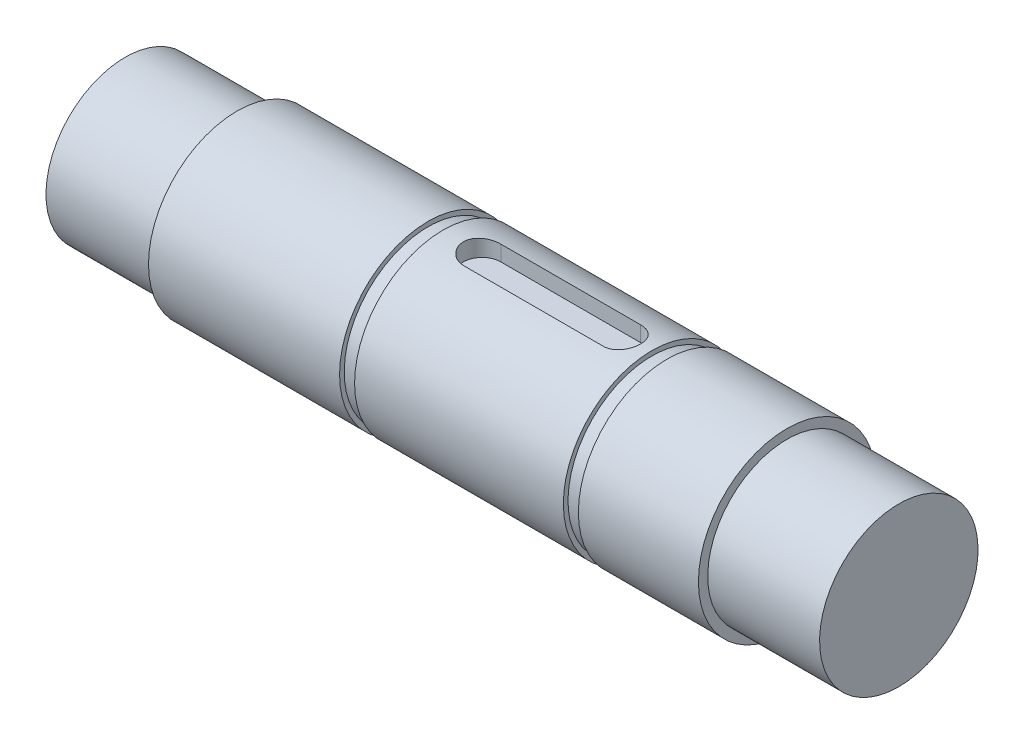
ISO-10303-21;
HEADER;
FILE_DESCRIPTION(('STEP AP214'),'2;1');
FILE_NAME('part.step','',(''),(''),'','','');
FILE_SCHEMA(('AUTOMOTIVE_DESIGN { 1 0 10303 214 1 1 1 1 }'));
ENDSEC;
DATA;
#1=APPLICATION_CONTEXT('core data for automotive mechanical design processes');
#2=APPLICATION_PROTOCOL_DEFINITION('international standard','automotive_design',2000,#1);
#3=PRODUCT_CONTEXT('',#1,'mechanical');
#4=PRODUCT('Part','Part','',(#3));
#5=PRODUCT_RELATED_PRODUCT_CATEGORY('part','',(#4));
#6=PRODUCT_DEFINITION_FORMATION('','',#4);
#7=PRODUCT_DEFINITION_CONTEXT('part definition',#1,'design');
#8=PRODUCT_DEFINITION('design','',#6,#7);
#9=PRODUCT_DEFINITION_SHAPE('','',#8);
#10=(LENGTH_UNIT() NAMED_UNIT(*) SI_UNIT(.MILLI.,.METRE.));
#11=(NAMED_UNIT(*) PLANE_ANGLE_UNIT() SI_UNIT($,.RADIAN.));
#12=(NAMED_UNIT(*) SI_UNIT($,.STERADIAN.) SOLID_ANGLE_UNIT());
#13=UNCERTAINTY_MEASURE_WITH_UNIT(LENGTH_MEASURE(1.E-05),#10,'distance_accuracy_value','');
#14=(GEOMETRIC_REPRESENTATION_CONTEXT(3) GLOBAL_UNCERTAINTY_ASSIGNED_CONTEXT((#13)) GLOBAL_UNIT_ASSIGNED_CONTEXT((#10,
#11,#12)) REPRESENTATION_CONTEXT('',''));
#15=CARTESIAN_POINT('',(0.,0.,0.));
#16=DIRECTION('',(0.,0.,1.));
#17=DIRECTION('',(1.,0.,0.));
#18=AXIS2_PLACEMENT_3D('',#15,#16,#17);
#19=CARTESIAN_POINT('',(70.9267361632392,9.41100770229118,0.));
#20=DIRECTION('',(-1.,0.,0.));
#21=DIRECTION('',(0.,-1.,0.));
#22=AXIS2_PLACEMENT_3D('',#19,#20,#21);
#23=CYLINDRICAL_SURFACE('',#22,9.50000000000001);
#24=CARTESIAN_POINT('',(127.436736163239,9.41100770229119,0.));
#25=DIRECTION('',(-1.,0.,0.));
#26=DIRECTION('',(0.,-1.,0.));
#27=AXIS2_PLACEMENT_3D('',#24,#25,#26);
#28=CIRCLE('',#27,9.50000000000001);
#29=CARTESIAN_POINT('',(127.436736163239,-0.0889922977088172,0.));
#30=VERTEX_POINT('',#29);
#31=EDGE_CURVE('E127',#30,#30,#28,.T.);
#32=ORIENTED_EDGE('',*,*,#31,.T.);
#33=EDGE_LOOP('',(#32));
#34=FACE_BOUND('',#33,.T.);
#35=CARTESIAN_POINT('',(105.036736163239,9.41100770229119,0.));
#36=DIRECTION('',(-1.,0.,0.));
#37=DIRECTION('',(0.,-1.,0.));
#38=AXIS2_PLACEMENT_3D('',#35,#36,#37);
#39=CIRCLE('',#38,9.5);
#40=CARTESIAN_POINT('',(105.036736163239,-0.0889922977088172,0.));
#41=VERTEX_POINT('',#40);
#42=EDGE_CURVE('E130',#41,#41,#39,.T.);
#43=ORIENTED_EDGE('',*,*,#42,.F.);
#44=EDGE_LOOP('',(#43));
#45=FACE_BOUND('',#44,.T.);
#46=DIRECTION('',(-1.,0.,0.));
#47=VECTOR('',#46,1.);
#48=CARTESIAN_POINT('',(70.9267361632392,18.6980955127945,2.));
#49=LINE('',#48,#47);
#50=CARTESIAN_POINT('',(109.220439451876,18.6980955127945,2.));
#51=VERTEX_POINT('',#50);
#52=CARTESIAN_POINT('',(124.220439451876,18.6980955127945,2.));
#53=VERTEX_POINT('',#52);
#54=EDGE_CURVE('E50',#51,#53,#49,.F.);
#55=ORIENTED_EDGE('',*,*,#54,.F.);
#56=CARTESIAN_POINT('',(109.220439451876,18.6980955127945,2.));
#57=CARTESIAN_POINT('',(109.164837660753,18.6980924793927,2.00000036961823));
#58=CARTESIAN_POINT('',(109.109263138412,18.6985954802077,1.99767985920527));
#59=CARTESIAN_POINT('',(108.998524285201,18.7005819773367,1.98842727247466));
#60=CARTESIAN_POINT('',(108.943359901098,18.702065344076,1.98149580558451));
#61=CARTESIAN_POINT('',(108.779266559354,18.7079290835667,1.9538753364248));
#62=CARTESIAN_POINT('',(108.671456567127,18.713723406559,1.92635991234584));
#63=CARTESIAN_POINT('',(108.462118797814,18.7284166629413,1.85397836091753));
#64=CARTESIAN_POINT('',(108.360591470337,18.7373158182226,1.80911099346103));
#65=CARTESIAN_POINT('',(108.166470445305,18.7572113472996,1.70333893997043));
#66=CARTESIAN_POINT('',(108.073877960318,18.7682080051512,1.64243208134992));
#67=CARTESIAN_POINT('',(107.898855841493,18.7912495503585,1.5053071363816));
#68=CARTESIAN_POINT('',(107.816585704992,18.8033069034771,1.42888762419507));
#69=CARTESIAN_POINT('',(107.665924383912,18.8270031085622,1.2633333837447));
#70=CARTESIAN_POINT('',(107.59753536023,18.8386418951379,1.17419667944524));
#71=CARTESIAN_POINT('',(107.475957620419,18.8603247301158,0.984671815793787));
#72=CARTESIAN_POINT('',(107.422922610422,18.8703522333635,0.884183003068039));
#73=CARTESIAN_POINT('',(107.334553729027,18.8875406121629,0.675478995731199));
#74=CARTESIAN_POINT('',(107.299217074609,18.8947019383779,0.56726501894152));
#75=CARTESIAN_POINT('',(107.247747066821,18.9052630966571,0.347847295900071));
#76=CARTESIAN_POINT('',(107.231341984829,18.9087161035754,0.236709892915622));
#77=CARTESIAN_POINT('',(107.217351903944,18.9116555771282,0.0132077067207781));
#78=CARTESIAN_POINT('',(107.219765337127,18.91114237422,-0.0991569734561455));
#79=CARTESIAN_POINT('',(107.243140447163,18.9062479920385,-0.320048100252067));
#80=CARTESIAN_POINT('',(107.263808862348,18.901927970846,-0.428607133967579));
#81=CARTESIAN_POINT('',(107.32264071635,18.8899747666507,-0.640679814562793));
#82=CARTESIAN_POINT('',(107.360804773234,18.8823414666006,-0.744193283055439));
#83=CARTESIAN_POINT('',(107.453810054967,18.8645198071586,-0.944063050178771));
#84=CARTESIAN_POINT('',(107.508764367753,18.8543142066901,-1.04036512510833));
#85=CARTESIAN_POINT('',(107.633704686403,18.8324701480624,-1.22248539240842));
#86=CARTESIAN_POINT('',(107.70369214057,18.8208315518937,-1.30830257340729));
#87=CARTESIAN_POINT('',(107.858303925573,18.7971399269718,-1.46875307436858));
#88=CARTESIAN_POINT('',(107.943183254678,18.7850832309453,-1.54314030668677));
#89=CARTESIAN_POINT('',(108.12436236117,18.7621213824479,-1.67668718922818));
#90=CARTESIAN_POINT('',(108.22066527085,18.7512165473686,-1.73584264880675));
#91=CARTESIAN_POINT('',(108.422350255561,18.7317825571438,-1.83734744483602));
#92=CARTESIAN_POINT('',(108.527759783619,18.723260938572,-1.87964364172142));
#93=CARTESIAN_POINT('',(108.744344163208,18.7096661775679,-1.94579296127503));
#94=CARTESIAN_POINT('',(108.855510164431,18.7045879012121,-1.9696735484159));
#95=CARTESIAN_POINT('',(109.009723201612,18.7003899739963,-1.98932013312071));
#96=CARTESIAN_POINT('',(109.051798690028,18.6995305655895,-1.99332635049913));
#97=CARTESIAN_POINT('',(109.136056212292,18.6983837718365,-1.99866298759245));
#98=CARTESIAN_POINT('',(109.178237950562,18.6980954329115,-1.99999786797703));
#99=CARTESIAN_POINT('',(109.220439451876,18.6980955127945,-2.));
#100=B_SPLINE_CURVE_WITH_KNOTS('',3,(#56,#57,#58,#59,#60,#61,#62,#63,#64,#65,#66,#67,#68,#69,
#70,#71,#72,#73,#74,#75,#76,#77,#78,#79,#80,#81,#82,#83,#84,#85,#86,#87,#88,#89,#90,#91,#92,#93,
#94,#95,#96,#97,#98,#99),.UNSPECIFIED.,.F.,.F.,(4,2,2,2,2,2,2,2,2,2,2,2,2,2,2,2,2,2,2,2,2,4),
(0.,0.16670089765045,0.333379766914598,0.665905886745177,0.998455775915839,1.3310507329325,
1.66827773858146,2.0055572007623,2.3461047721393,2.68659877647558,3.02214231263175,
3.35765789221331,3.68787958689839,4.01811294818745,4.35062149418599,4.68316208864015,
5.02208107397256,5.36109320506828,5.70116559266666,6.04072982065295,6.16748468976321,
6.29402772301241),.UNSPECIFIED.);
#101=CARTESIAN_POINT('',(109.220439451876,18.6980955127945,-2.));
#102=VERTEX_POINT('',#101);
#103=EDGE_CURVE('E84',#51,#102,#100,.T.);
#104=ORIENTED_EDGE('',*,*,#103,.T.);
#105=DIRECTION('',(-1.,0.,0.));
#106=VECTOR('',#105,1.);
#107=CARTESIAN_POINT('',(70.9267361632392,18.6980955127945,-2.));
#108=LINE('',#107,#106);
#109=CARTESIAN_POINT('',(124.220439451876,18.6980955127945,-2.));
#110=VERTEX_POINT('',#109);
#111=EDGE_CURVE('E11',#110,#102,#108,.T.);
#112=ORIENTED_EDGE('',*,*,#111,.F.);
#113=CARTESIAN_POINT('',(124.220439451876,18.6980955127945,-2.));
#114=CARTESIAN_POINT('',(124.276041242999,18.6980924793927,-2.00000036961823));
#115=CARTESIAN_POINT('',(124.33161576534,18.6985954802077,-1.99767985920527));
#116=CARTESIAN_POINT('',(124.44235461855,18.7005819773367,-1.98842727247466));
#117=CARTESIAN_POINT('',(124.497519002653,18.702065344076,-1.98149580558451));
#118=CARTESIAN_POINT('',(124.661612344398,18.7079290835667,-1.95387533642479));
#119=CARTESIAN_POINT('',(124.769422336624,18.713723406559,-1.92635991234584));
#120=CARTESIAN_POINT('',(124.978760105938,18.7284166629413,-1.85397836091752));
#121=CARTESIAN_POINT('',(125.080287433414,18.7373158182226,-1.80911099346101));
#122=CARTESIAN_POINT('',(125.274408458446,18.7572113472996,-1.70333893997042));
#123=CARTESIAN_POINT('',(125.367000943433,18.7682080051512,-1.64243208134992));
#124=CARTESIAN_POINT('',(125.542023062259,18.7912495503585,-1.5053071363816));
#125=CARTESIAN_POINT('',(125.624293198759,18.8033069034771,-1.42888762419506));
#126=CARTESIAN_POINT('',(125.774954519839,18.8270031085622,-1.26333338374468));
#127=CARTESIAN_POINT('',(125.843343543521,18.8386418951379,-1.17419667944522));
#128=CARTESIAN_POINT('',(125.964921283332,18.8603247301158,-0.984671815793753));
#129=CARTESIAN_POINT('',(126.01795629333,18.8703522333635,-0.884183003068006));
#130=CARTESIAN_POINT('',(126.106325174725,18.8875406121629,-0.675478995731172));
#131=CARTESIAN_POINT('',(126.141661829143,18.8947019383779,-0.567265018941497));
#132=CARTESIAN_POINT('',(126.19313183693,18.9052630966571,-0.347847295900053));
#133=CARTESIAN_POINT('',(126.209536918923,18.9087161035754,-0.236709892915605));
#134=CARTESIAN_POINT('',(126.223526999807,18.9116555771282,-0.0132077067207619));
#135=CARTESIAN_POINT('',(126.221113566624,18.91114237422,0.0991569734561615));
#136=CARTESIAN_POINT('',(126.197738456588,18.9062479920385,0.320048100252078));
#137=CARTESIAN_POINT('',(126.177070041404,18.901927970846,0.428607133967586));
#138=CARTESIAN_POINT('',(126.118238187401,18.8899747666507,0.640679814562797));
#139=CARTESIAN_POINT('',(126.080074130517,18.8823414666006,0.744193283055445));
#140=CARTESIAN_POINT('',(125.987068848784,18.8645198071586,0.944063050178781));
#141=CARTESIAN_POINT('',(125.932114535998,18.8543142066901,1.04036512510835));
#142=CARTESIAN_POINT('',(125.807174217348,18.8324701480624,1.22248539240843));
#143=CARTESIAN_POINT('',(125.737186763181,18.8208315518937,1.3083025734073));
#144=CARTESIAN_POINT('',(125.582574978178,18.7971399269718,1.46875307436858));
#145=CARTESIAN_POINT('',(125.497695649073,18.7850832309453,1.54314030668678));
#146=CARTESIAN_POINT('',(125.316516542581,18.7621213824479,1.67668718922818));
#147=CARTESIAN_POINT('',(125.220213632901,18.7512165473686,1.73584264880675));
#148=CARTESIAN_POINT('',(125.018528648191,18.7317825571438,1.83734744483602));
#149=CARTESIAN_POINT('',(124.913119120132,18.723260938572,1.87964364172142));
#150=CARTESIAN_POINT('',(124.696534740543,18.7096661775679,1.94579296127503));
#151=CARTESIAN_POINT('',(124.58536873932,18.7045879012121,1.9696735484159));
#152=CARTESIAN_POINT('',(124.431155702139,18.7003899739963,1.98932013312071));
#153=CARTESIAN_POINT('',(124.389080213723,18.6995305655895,1.99332635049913));
#154=CARTESIAN_POINT('',(124.304822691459,18.6983837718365,1.99866298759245));
#155=CARTESIAN_POINT('',(124.262640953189,18.6980954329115,1.99999786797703));
#156=CARTESIAN_POINT('',(124.220439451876,18.6980955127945,2.));
#157=B_SPLINE_CURVE_WITH_KNOTS('',3,(#113,#114,#115,#116,#117,#118,#119,#120,#121,#122,#123,
#124,#125,#126,#127,#128,#129,#130,#131,#132,#133,#134,#135,#136,#137,#138,#139,#140,#141,#142,
#143,#144,#145,#146,#147,#148,#149,#150,#151,#152,#153,#154,#155,#156),.UNSPECIFIED.,.F.,.F.,(4,
2,2,2,2,2,2,2,2,2,2,2,2,2,2,2,2,2,2,2,2,4),(0.,0.166700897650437,0.333379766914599,
0.665905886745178,0.998455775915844,1.33105073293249,1.66827773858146,2.00555720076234,
2.34610477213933,2.68659877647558,3.02214231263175,3.35765789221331,3.68787958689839,
4.01811294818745,4.35062149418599,4.68316208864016,5.02208107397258,5.36109320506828,
5.70116559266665,6.04072982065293,6.1674846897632,6.2940277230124),.UNSPECIFIED.);
#158=EDGE_CURVE('E108',#110,#53,#157,.T.);
#159=ORIENTED_EDGE('',*,*,#158,.T.);
#160=EDGE_LOOP('',(#55,#104,#112,#159));
#161=FACE_BOUND('',#160,.T.);
#162=ADVANCED_FACE('F41',(#34,#45,#161),#23,.T.);
#163=CARTESIAN_POINT('',(70.9267361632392,0.,0.));
#164=DIRECTION('',(1.,0.,0.));
#165=DIRECTION('',(0.,1.,0.));
#166=AXIS2_PLACEMENT_3D('',#163,#164,#165);
#167=PLANE('',#166);
#168=CARTESIAN_POINT('',(70.9267361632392,9.41100770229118,0.));
#169=DIRECTION('',(-1.,0.,0.));
#170=DIRECTION('',(0.,-1.,0.));
#171=AXIS2_PLACEMENT_3D('',#168,#169,#170);
#172=CIRCLE('',#171,8.5);
#173=CARTESIAN_POINT('',(70.9267361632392,0.911007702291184,0.));
#174=VERTEX_POINT('',#173);
#175=EDGE_CURVE('E148',#174,#174,#172,.T.);
#176=ORIENTED_EDGE('',*,*,#175,.T.);
#177=EDGE_LOOP('',(#176));
#178=FACE_BOUND('',#177,.T.);
#179=ADVANCED_FACE('F43',(#178),#167,.F.);
#180=CARTESIAN_POINT('',(70.9267361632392,9.41100770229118,0.));
#181=DIRECTION('',(-1.,0.,0.));
#182=DIRECTION('',(0.,-1.,0.));
#183=AXIS2_PLACEMENT_3D('',#180,#181,#182);
#184=CYLINDRICAL_SURFACE('',#183,8.5);
#185=CARTESIAN_POINT('',(82.9267361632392,9.41100770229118,0.));
#186=DIRECTION('',(-1.,0.,0.));
#187=DIRECTION('',(0.,-1.,0.));
#188=AXIS2_PLACEMENT_3D('',#185,#186,#187);
#189=CIRCLE('',#188,8.5);
#190=CARTESIAN_POINT('',(82.9267361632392,0.911007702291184,0.));
#191=VERTEX_POINT('',#190);
#192=EDGE_CURVE('E145',#191,#191,#189,.T.);
#193=ORIENTED_EDGE('',*,*,#192,.T.);
#194=EDGE_LOOP('',(#193));
#195=FACE_BOUND('',#194,.T.);
#196=ORIENTED_EDGE('',*,*,#175,.F.);
#197=EDGE_LOOP('',(#196));
#198=FACE_BOUND('',#197,.T.);
#199=ADVANCED_FACE('F153',(#195,#198),#184,.T.);
#200=CARTESIAN_POINT('',(82.9267361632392,0.,0.));
#201=DIRECTION('',(-1.,0.,0.));
#202=DIRECTION('',(0.,-1.,0.));
#203=AXIS2_PLACEMENT_3D('',#200,#201,#202);
#204=PLANE('',#203);
#205=CARTESIAN_POINT('',(82.9267361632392,9.41100770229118,0.));
#206=DIRECTION('',(-1.,0.,0.));
#207=DIRECTION('',(0.,-1.,0.));
#208=AXIS2_PLACEMENT_3D('',#205,#206,#207);
#209=CIRCLE('',#208,9.5);
#210=CARTESIAN_POINT('',(82.9267361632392,-0.0889922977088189,0.));
#211=VERTEX_POINT('',#210);
#212=EDGE_CURVE('E142',#211,#211,#209,.T.);
#213=ORIENTED_EDGE('',*,*,#212,.T.);
#214=EDGE_LOOP('',(#213));
#215=FACE_BOUND('',#214,.T.);
#216=ORIENTED_EDGE('',*,*,#192,.F.);
#217=EDGE_LOOP('',(#216));
#218=FACE_BOUND('',#217,.T.);
#219=ADVANCED_FACE('F155',(#215,#218),#204,.T.);
#220=CARTESIAN_POINT('',(70.9267361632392,9.41100770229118,0.));
#221=DIRECTION('',(-1.,0.,0.));
#222=DIRECTION('',(0.,-1.,0.));
#223=AXIS2_PLACEMENT_3D('',#220,#221,#222);
#224=CYLINDRICAL_SURFACE('',#223,9.5);
#225=ORIENTED_EDGE('',*,*,#212,.F.);
#226=EDGE_LOOP('',(#225));
#227=FACE_BOUND('',#226,.T.);
#228=CARTESIAN_POINT('',(103.426736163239,9.41100770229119,0.));
#229=DIRECTION('',(-1.,0.,0.));
#230=DIRECTION('',(0.,-1.,0.));
#231=AXIS2_PLACEMENT_3D('',#228,#229,#230);
#232=CIRCLE('',#231,9.5);
#233=CARTESIAN_POINT('',(103.426736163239,-0.0889922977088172,0.));
#234=VERTEX_POINT('',#233);
#235=EDGE_CURVE('E139',#234,#234,#232,.T.);
#236=ORIENTED_EDGE('',*,*,#235,.T.);
#237=EDGE_LOOP('',(#236));
#238=FACE_BOUND('',#237,.T.);
#239=ADVANCED_FACE('F161',(#227,#238),#224,.T.);
#240=CARTESIAN_POINT('',(103.426736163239,0.,0.));
#241=DIRECTION('',(-1.,0.,0.));
#242=DIRECTION('',(0.,-1.,0.));
#243=AXIS2_PLACEMENT_3D('',#240,#241,#242);
#244=PLANE('',#243);
#245=ORIENTED_EDGE('',*,*,#235,.F.);
#246=EDGE_LOOP('',(#245));
#247=FACE_BOUND('',#246,.T.);
#248=CARTESIAN_POINT('',(103.426736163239,9.41100770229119,0.));
#249=DIRECTION('',(-1.,0.,0.));
#250=DIRECTION('',(0.,-1.,0.));
#251=AXIS2_PLACEMENT_3D('',#248,#249,#250);
#252=CIRCLE('',#251,9.);
#253=CARTESIAN_POINT('',(103.426736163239,0.411007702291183,0.));
#254=VERTEX_POINT('',#253);
#255=EDGE_CURVE('E136',#254,#254,#252,.T.);
#256=ORIENTED_EDGE('',*,*,#255,.T.);
#257=EDGE_LOOP('',(#256));
#258=FACE_BOUND('',#257,.T.);
#259=ADVANCED_FACE('F244',(#247,#258),#244,.F.);
#260=CARTESIAN_POINT('',(70.9267361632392,9.41100770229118,0.));
#261=DIRECTION('',(-1.,0.,0.));
#262=DIRECTION('',(0.,-1.,0.));
#263=AXIS2_PLACEMENT_3D('',#260,#261,#262);
#264=CYLINDRICAL_SURFACE('',#263,9.);
#265=ORIENTED_EDGE('',*,*,#255,.F.);
#266=EDGE_LOOP('',(#265));
#267=FACE_BOUND('',#266,.T.);
#268=CARTESIAN_POINT('',(105.036736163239,9.41100770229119,0.));
#269=DIRECTION('',(-1.,0.,0.));
#270=DIRECTION('',(0.,-1.,0.));
#271=AXIS2_PLACEMENT_3D('',#268,#269,#270);
#272=CIRCLE('',#271,9.);
#273=CARTESIAN_POINT('',(105.036736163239,0.411007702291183,0.));
#274=VERTEX_POINT('',#273);
#275=EDGE_CURVE('E133',#274,#274,#272,.T.);
#276=ORIENTED_EDGE('',*,*,#275,.T.);
#277=EDGE_LOOP('',(#276));
#278=FACE_BOUND('',#277,.T.);
#279=ADVANCED_FACE('F239',(#267,#278),#264,.T.);
#280=CARTESIAN_POINT('',(105.036736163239,0.,0.));
#281=DIRECTION('',(1.,0.,0.));
#282=DIRECTION('',(0.,1.,0.));
#283=AXIS2_PLACEMENT_3D('',#280,#281,#282);
#284=PLANE('',#283);
#285=ORIENTED_EDGE('',*,*,#275,.F.);
#286=EDGE_LOOP('',(#285));
#287=FACE_BOUND('',#286,.T.);
#288=ORIENTED_EDGE('',*,*,#42,.T.);
#289=EDGE_LOOP('',(#288));
#290=FACE_BOUND('',#289,.T.);
#291=ADVANCED_FACE('F177',(#287,#290),#284,.F.);
#292=CARTESIAN_POINT('',(127.436736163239,0.,0.));
#293=DIRECTION('',(1.,0.,0.));
#294=DIRECTION('',(0.,1.,0.));
#295=AXIS2_PLACEMENT_3D('',#292,#293,#294);
#296=PLANE('',#295);
#297=CARTESIAN_POINT('',(127.436736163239,9.41100770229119,0.));
#298=DIRECTION('',(-1.,0.,0.));
#299=DIRECTION('',(0.,-1.,0.));
#300=AXIS2_PLACEMENT_3D('',#297,#298,#299);
#301=CIRCLE('',#300,9.00000000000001);
#302=CARTESIAN_POINT('',(127.436736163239,0.411007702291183,0.));
#303=VERTEX_POINT('',#302);
#304=EDGE_CURVE('E124',#303,#303,#301,.T.);
#305=ORIENTED_EDGE('',*,*,#304,.T.);
#306=EDGE_LOOP('',(#305));
#307=FACE_BOUND('',#306,.T.);
#308=ORIENTED_EDGE('',*,*,#31,.F.);
#309=EDGE_LOOP('',(#308));
#310=FACE_BOUND('',#309,.T.);
#311=ADVANCED_FACE('F175',(#307,#310),#296,.T.);
#312=CARTESIAN_POINT('',(70.9267361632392,9.41100770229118,0.));
#313=DIRECTION('',(-1.,0.,0.));
#314=DIRECTION('',(0.,-1.,0.));
#315=AXIS2_PLACEMENT_3D('',#312,#313,#314);
#316=CYLINDRICAL_SURFACE('',#315,9.00000000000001);
#317=CARTESIAN_POINT('',(129.046736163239,9.41100770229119,0.));
#318=DIRECTION('',(-1.,0.,0.));
#319=DIRECTION('',(0.,-1.,0.));
#320=AXIS2_PLACEMENT_3D('',#317,#318,#319);
#321=CIRCLE('',#320,9.00000000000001);
#322=CARTESIAN_POINT('',(129.046736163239,0.411007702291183,0.));
#323=VERTEX_POINT('',#322);
#324=EDGE_CURVE('E121',#323,#323,#321,.T.);
#325=ORIENTED_EDGE('',*,*,#324,.T.);
#326=EDGE_LOOP('',(#325));
#327=FACE_BOUND('',#326,.T.);
#328=ORIENTED_EDGE('',*,*,#304,.F.);
#329=EDGE_LOOP('',(#328));
#330=FACE_BOUND('',#329,.T.);
#331=ADVANCED_FACE('F222',(#327,#330),#316,.T.);
#332=CARTESIAN_POINT('',(129.046736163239,0.,0.));
#333=DIRECTION('',(-1.,0.,0.));
#334=DIRECTION('',(0.,-1.,0.));
#335=AXIS2_PLACEMENT_3D('',#332,#333,#334);
#336=PLANE('',#335);
#337=CARTESIAN_POINT('',(129.046736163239,9.41100770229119,0.));
#338=DIRECTION('',(-1.,0.,0.));
#339=DIRECTION('',(0.,-1.,0.));
#340=AXIS2_PLACEMENT_3D('',#337,#338,#339);
#341=CIRCLE('',#340,9.50000000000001);
#342=CARTESIAN_POINT('',(129.046736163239,-0.0889922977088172,0.));
#343=VERTEX_POINT('',#342);
#344=EDGE_CURVE('E118',#343,#343,#341,.T.);
#345=ORIENTED_EDGE('',*,*,#344,.T.);
#346=EDGE_LOOP('',(#345));
#347=FACE_BOUND('',#346,.T.);
#348=ORIENTED_EDGE('',*,*,#324,.F.);
#349=EDGE_LOOP('',(#348));
#350=FACE_BOUND('',#349,.T.);
#351=ADVANCED_FACE('F219',(#347,#350),#336,.T.);
#352=CARTESIAN_POINT('',(70.9267361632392,9.41100770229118,0.));
#353=DIRECTION('',(-1.,0.,0.));
#354=DIRECTION('',(0.,-1.,0.));
#355=AXIS2_PLACEMENT_3D('',#352,#353,#354);
#356=CYLINDRICAL_SURFACE('',#355,9.50000000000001);
#357=CARTESIAN_POINT('',(141.926736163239,9.41100770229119,0.));
#358=DIRECTION('',(-1.,0.,0.));
#359=DIRECTION('',(0.,-1.,0.));
#360=AXIS2_PLACEMENT_3D('',#357,#358,#359);
#361=CIRCLE('',#360,9.50000000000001);
#362=CARTESIAN_POINT('',(141.926736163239,-0.0889922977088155,0.));
#363=VERTEX_POINT('',#362);
#364=EDGE_CURVE('E115',#363,#363,#361,.T.);
#365=ORIENTED_EDGE('',*,*,#364,.T.);
#366=EDGE_LOOP('',(#365));
#367=FACE_BOUND('',#366,.T.);
#368=ORIENTED_EDGE('',*,*,#344,.F.);
#369=EDGE_LOOP('',(#368));
#370=FACE_BOUND('',#369,.T.);
#371=ADVANCED_FACE('F215',(#367,#370),#356,.T.);
#372=CARTESIAN_POINT('',(141.926736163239,0.,0.));
#373=DIRECTION('',(-1.,0.,0.));
#374=DIRECTION('',(0.,-1.,0.));
#375=AXIS2_PLACEMENT_3D('',#372,#373,#374);
#376=PLANE('',#375);
#377=ORIENTED_EDGE('',*,*,#364,.F.);
#378=EDGE_LOOP('',(#377));
#379=FACE_BOUND('',#378,.T.);
#380=CARTESIAN_POINT('',(141.926736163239,9.41100770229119,0.));
#381=DIRECTION('',(-1.,0.,0.));
#382=DIRECTION('',(0.,-1.,0.));
#383=AXIS2_PLACEMENT_3D('',#380,#381,#382);
#384=CIRCLE('',#383,8.5);
#385=CARTESIAN_POINT('',(141.926736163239,0.911007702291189,0.));
#386=VERTEX_POINT('',#385);
#387=EDGE_CURVE('E112',#386,#386,#384,.T.);
#388=ORIENTED_EDGE('',*,*,#387,.T.);
#389=EDGE_LOOP('',(#388));
#390=FACE_BOUND('',#389,.T.);
#391=ADVANCED_FACE('F211',(#379,#390),#376,.F.);
#392=CARTESIAN_POINT('',(70.9267361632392,9.41100770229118,0.));
#393=DIRECTION('',(-1.,0.,0.));
#394=DIRECTION('',(0.,-1.,0.));
#395=AXIS2_PLACEMENT_3D('',#392,#393,#394);
#396=CYLINDRICAL_SURFACE('',#395,8.5);
#397=CARTESIAN_POINT('',(153.926736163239,9.41100770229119,0.));
#398=DIRECTION('',(-1.,0.,0.));
#399=DIRECTION('',(0.,-1.,0.));
#400=AXIS2_PLACEMENT_3D('',#397,#398,#399);
#401=CIRCLE('',#400,8.5);
#402=CARTESIAN_POINT('',(153.926736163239,0.911007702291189,0.));
#403=VERTEX_POINT('',#402);
#404=EDGE_CURVE('E93',#403,#403,#401,.T.);
#405=ORIENTED_EDGE('',*,*,#404,.T.);
#406=EDGE_LOOP('',(#405));
#407=FACE_BOUND('',#406,.T.);
#408=ORIENTED_EDGE('',*,*,#387,.F.);
#409=EDGE_LOOP('',(#408));
#410=FACE_BOUND('',#409,.T.);
#411=ADVANCED_FACE('F207',(#407,#410),#396,.T.);
#412=CARTESIAN_POINT('',(153.926736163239,0.,0.));
#413=DIRECTION('',(1.,0.,0.));
#414=DIRECTION('',(0.,1.,0.));
#415=AXIS2_PLACEMENT_3D('',#412,#413,#414);
#416=PLANE('',#415);
#417=ORIENTED_EDGE('',*,*,#404,.F.);
#418=EDGE_LOOP('',(#417));
#419=FACE_BOUND('',#418,.T.);
#420=ADVANCED_FACE('F204',(#419),#416,.T.);
#421=CARTESIAN_POINT('',(124.220439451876,17.038403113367,-2.));
#422=DIRECTION('',(0.,0.,-1.));
#423=DIRECTION('',(0.,1.,0.));
#424=AXIS2_PLACEMENT_3D('',#421,#422,#423);
#425=PLANE('',#424);
#426=ORIENTED_EDGE('',*,*,#111,.T.);
#427=DIRECTION('',(0.,-1.,0.));
#428=VECTOR('',#427,1.);
#429=CARTESIAN_POINT('',(109.220439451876,17.038403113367,-2.));
#430=LINE('',#429,#428);
#431=CARTESIAN_POINT('',(109.220439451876,17.038403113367,-2.));
#432=VERTEX_POINT('',#431);
#433=EDGE_CURVE('E105',#102,#432,#430,.T.);
#434=ORIENTED_EDGE('',*,*,#433,.T.);
#435=DIRECTION('',(-1.,0.,0.));
#436=VECTOR('',#435,1.);
#437=CARTESIAN_POINT('',(124.220439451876,17.038403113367,-2.));
#438=LINE('',#437,#436);
#439=CARTESIAN_POINT('',(124.220439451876,17.038403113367,-2.));
#440=VERTEX_POINT('',#439);
#441=EDGE_CURVE('E94',#440,#432,#438,.T.);
#442=ORIENTED_EDGE('',*,*,#441,.F.);
#443=DIRECTION('',(0.,-1.,0.));
#444=VECTOR('',#443,1.);
#445=CARTESIAN_POINT('',(124.220439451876,17.038403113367,-2.));
#446=LINE('',#445,#444);
#447=EDGE_CURVE('E82',#110,#440,#446,.T.);
#448=ORIENTED_EDGE('',*,*,#447,.F.);
#449=EDGE_LOOP('',(#426,#434,#442,#448));
#450=FACE_BOUND('',#449,.T.);
#451=ADVANCED_FACE('F200',(#450),#425,.F.);
#452=CARTESIAN_POINT('',(124.220439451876,17.038403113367,2.));
#453=DIRECTION('',(0.,0.,1.));
#454=DIRECTION('',(0.,-1.,0.));
#455=AXIS2_PLACEMENT_3D('',#452,#453,#454);
#456=PLANE('',#455);
#457=ORIENTED_EDGE('',*,*,#54,.T.);
#458=DIRECTION('',(0.,1.,0.));
#459=VECTOR('',#458,1.);
#460=CARTESIAN_POINT('',(124.220439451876,17.038403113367,2.));
#461=LINE('',#460,#459);
#462=CARTESIAN_POINT('',(124.220439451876,17.038403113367,2.));
#463=VERTEX_POINT('',#462);
#464=EDGE_CURVE('E79',#463,#53,#461,.T.);
#465=ORIENTED_EDGE('',*,*,#464,.F.);
#466=DIRECTION('',(-1.,0.,0.));
#467=VECTOR('',#466,1.);
#468=CARTESIAN_POINT('',(124.220439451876,17.038403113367,2.));
#469=LINE('',#468,#467);
#470=CARTESIAN_POINT('',(109.220439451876,17.038403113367,2.));
#471=VERTEX_POINT('',#470);
#472=EDGE_CURVE('E88',#463,#471,#469,.T.);
#473=ORIENTED_EDGE('',*,*,#472,.T.);
#474=DIRECTION('',(0.,1.,0.));
#475=VECTOR('',#474,1.);
#476=CARTESIAN_POINT('',(109.220439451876,17.038403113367,2.));
#477=LINE('',#476,#475);
#478=EDGE_CURVE('E101',#471,#51,#477,.T.);
#479=ORIENTED_EDGE('',*,*,#478,.T.);
#480=EDGE_LOOP('',(#457,#465,#473,#479));
#481=FACE_BOUND('',#480,.T.);
#482=ADVANCED_FACE('F97',(#481),#456,.F.);
#483=CARTESIAN_POINT('',(124.220439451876,17.038403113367,-2.));
#484=DIRECTION('',(0.,-1.,0.));
#485=DIRECTION('',(0.,0.,-1.));
#486=AXIS2_PLACEMENT_3D('',#483,#484,#485);
#487=PLANE('',#486);
#488=ORIENTED_EDGE('',*,*,#441,.T.);
#489=CARTESIAN_POINT('',(109.220439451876,17.038403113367,0.));
#490=DIRECTION('',(0.,1.,0.));
#491=DIRECTION('',(0.,0.,1.));
#492=AXIS2_PLACEMENT_3D('',#489,#490,#491);
#493=CIRCLE('',#492,2.);
#494=EDGE_CURVE('E85',#432,#471,#493,.T.);
#495=ORIENTED_EDGE('',*,*,#494,.T.);
#496=ORIENTED_EDGE('',*,*,#472,.F.);
#497=CARTESIAN_POINT('',(124.220439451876,17.038403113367,0.));
#498=DIRECTION('',(0.,1.,0.));
#499=DIRECTION('',(0.,0.,-1.));
#500=AXIS2_PLACEMENT_3D('',#497,#498,#499);
#501=CIRCLE('',#500,2.);
#502=EDGE_CURVE('E56',#463,#440,#501,.T.);
#503=ORIENTED_EDGE('',*,*,#502,.T.);
#504=EDGE_LOOP('',(#488,#495,#496,#503));
#505=FACE_BOUND('',#504,.T.);
#506=ADVANCED_FACE('F89',(#505),#487,.F.);
#507=CARTESIAN_POINT('',(109.220439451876,27.038403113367,0.));
#508=DIRECTION('',(0.,-1.,0.));
#509=DIRECTION('',(0.,0.,-1.));
#510=AXIS2_PLACEMENT_3D('',#507,#508,#509);
#511=CYLINDRICAL_SURFACE('',#510,2.);
#512=ORIENTED_EDGE('',*,*,#478,.F.);
#513=ORIENTED_EDGE('',*,*,#494,.F.);
#514=ORIENTED_EDGE('',*,*,#433,.F.);
#515=ORIENTED_EDGE('',*,*,#103,.F.);
#516=EDGE_LOOP('',(#512,#513,#514,#515));
#517=FACE_BOUND('',#516,.T.);
#518=ADVANCED_FACE('F193',(#517),#511,.F.);
#519=CARTESIAN_POINT('',(124.220439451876,27.038403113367,0.));
#520=DIRECTION('',(0.,-1.,0.));
#521=DIRECTION('',(0.,0.,-1.));
#522=AXIS2_PLACEMENT_3D('',#519,#520,#521);
#523=CYLINDRICAL_SURFACE('',#522,2.);
#524=ORIENTED_EDGE('',*,*,#447,.T.);
#525=ORIENTED_EDGE('',*,*,#502,.F.);
#526=ORIENTED_EDGE('',*,*,#464,.T.);
#527=ORIENTED_EDGE('',*,*,#158,.F.);
#528=EDGE_LOOP('',(#524,#525,#526,#527));
#529=FACE_BOUND('',#528,.T.);
#530=ADVANCED_FACE('F77',(#529),#523,.F.);
#531=CLOSED_SHELL('',(#162,#179,#199,#219,#239,#259,#279,#291,#311,#331,#351,#371,#391,#411,
#420,#451,#482,#506,#518,#530));
#532=MANIFOLD_SOLID_BREP('B2',#531);
#533=ADVANCED_BREP_SHAPE_REPRESENTATION('',(#18,#532),#14);
#534=SHAPE_DEFINITION_REPRESENTATION(#9,#533);
ENDSEC;
END-ISO-10303-21;
